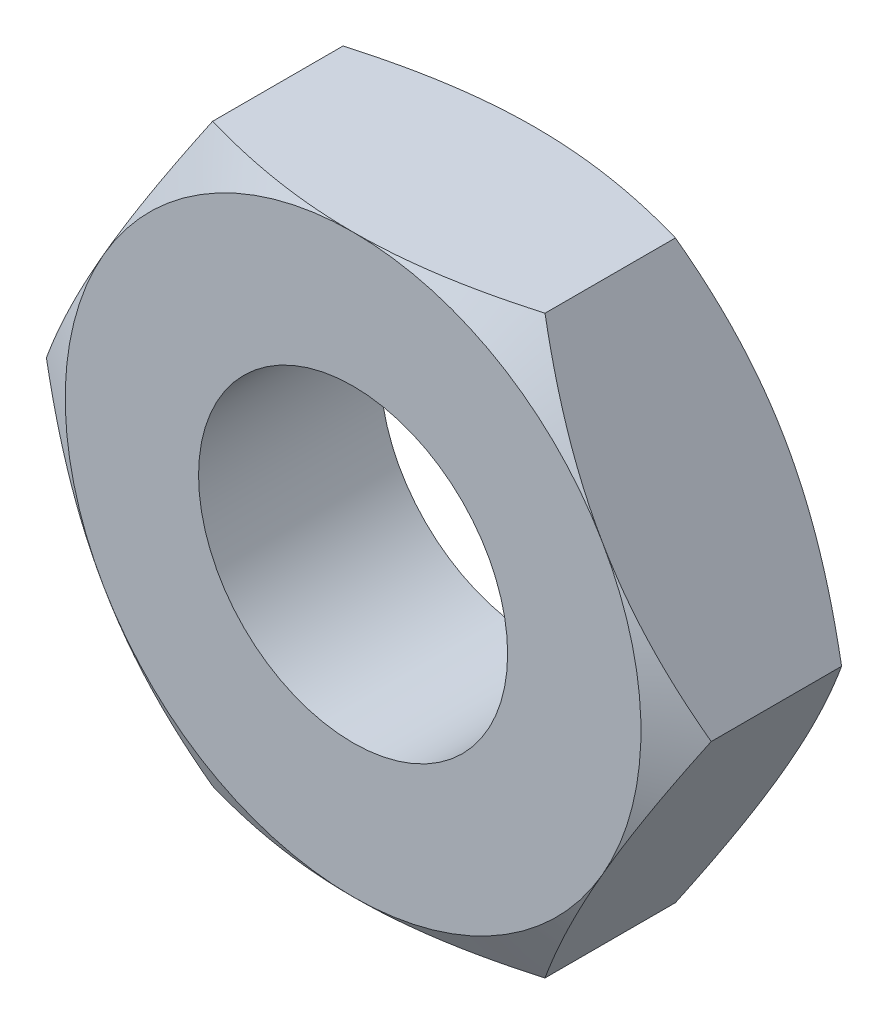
from build123d import *

# Parameters (mm, degrees)
EXTRUDE1_DEPTH = 3
TAPPED_HOLE1_D = 10.2


with BuildPart() as part:
    # Sketch1 → Extrude1 (new, symmetric)
    with BuildSketch(Plane.XY):
        Polygon((5.484827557, 9.5), (-5.484827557, 9.5), (-10.969655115, 0), (-5.484827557, -9.5), (5.484827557, -9.5), (10.969655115, 0), align=None)
    extrude(amount=EXTRUDE1_DEPTH, both=True)

    # Sketch2 → Cut-Revolve1 (revolve, cut)
    with BuildSketch(Plane(origin=(0, 0, 0), x_dir=(0, 0, -1), z_dir=(1, 0, 0))):
        Polygon((-3, 9.5), (-3, 19), (2.484827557, 19), align=None)
    cut_revolve1 = revolve(axis=Axis((0, 0, 0), (0, 0, -1)), mode=Mode.SUBTRACT)

    # Mirror1: Cut-Revolve1 across plane
    add(cut_revolve1.mirror(Plane.XY), mode=Mode.SUBTRACT)

    # Tapped Hole1 (through all)
    with Locations(Plane.XY.offset(3)):
        with Locations((0, 0)):
            Hole(TAPPED_HOLE1_D / 2)


solid = part.part
